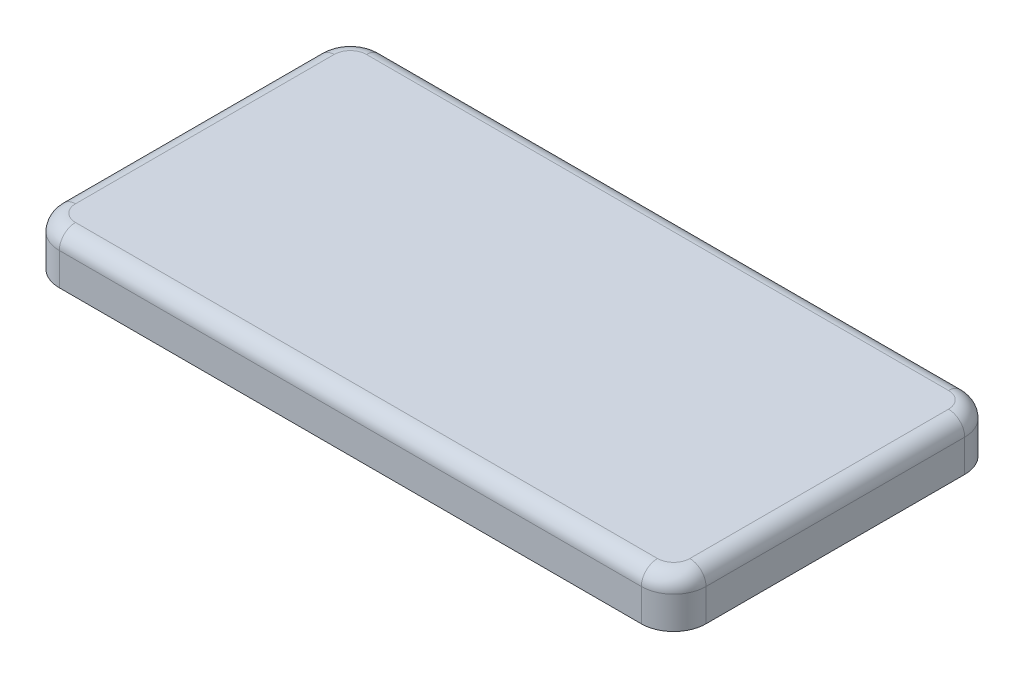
ISO-10303-21;
HEADER;
FILE_DESCRIPTION(('STEP AP214'),'2;1');
FILE_NAME('part.step','',(''),(''),'','','');
FILE_SCHEMA(('AUTOMOTIVE_DESIGN { 1 0 10303 214 1 1 1 1 }'));
ENDSEC;
DATA;
#1=APPLICATION_CONTEXT('core data for automotive mechanical design processes');
#2=APPLICATION_PROTOCOL_DEFINITION('international standard','automotive_design',2000,#1);
#3=PRODUCT_CONTEXT('',#1,'mechanical');
#4=PRODUCT('Part','Part','',(#3));
#5=PRODUCT_RELATED_PRODUCT_CATEGORY('part','',(#4));
#6=PRODUCT_DEFINITION_FORMATION('','',#4);
#7=PRODUCT_DEFINITION_CONTEXT('part definition',#1,'design');
#8=PRODUCT_DEFINITION('design','',#6,#7);
#9=PRODUCT_DEFINITION_SHAPE('','',#8);
#10=(LENGTH_UNIT() NAMED_UNIT(*) SI_UNIT(.MILLI.,.METRE.));
#11=(NAMED_UNIT(*) PLANE_ANGLE_UNIT() SI_UNIT($,.RADIAN.));
#12=(NAMED_UNIT(*) SI_UNIT($,.STERADIAN.) SOLID_ANGLE_UNIT());
#13=UNCERTAINTY_MEASURE_WITH_UNIT(LENGTH_MEASURE(1.E-05),#10,'distance_accuracy_value','');
#14=(GEOMETRIC_REPRESENTATION_CONTEXT(3) GLOBAL_UNCERTAINTY_ASSIGNED_CONTEXT((#13)) GLOBAL_UNIT_ASSIGNED_CONTEXT((#10,
#11,#12)) REPRESENTATION_CONTEXT('',''));
#15=CARTESIAN_POINT('',(0.,0.,0.));
#16=DIRECTION('',(0.,0.,1.));
#17=DIRECTION('',(1.,0.,0.));
#18=AXIS2_PLACEMENT_3D('',#15,#16,#17);
#19=CARTESIAN_POINT('',(-18.,-0.5,8.));
#20=DIRECTION('',(0.,-1.,0.));
#21=DIRECTION('',(0.,0.,-1.));
#22=AXIS2_PLACEMENT_3D('',#19,#20,#21);
#23=PLANE('',#22);
#24=DIRECTION('',(1.,0.,0.));
#25=VECTOR('',#24,1.);
#26=CARTESIAN_POINT('',(-12.15,-0.5,-1.3));
#27=LINE('',#26,#25);
#28=CARTESIAN_POINT('',(-12.15,-0.5,-1.3));
#29=VERTEX_POINT('',#28);
#30=CARTESIAN_POINT('',(-7.85,-0.5,-1.3));
#31=VERTEX_POINT('',#30);
#32=EDGE_CURVE('E284',#29,#31,#27,.T.);
#33=ORIENTED_EDGE('',*,*,#32,.F.);
#34=DIRECTION('',(0.,0.,-1.));
#35=VECTOR('',#34,1.);
#36=CARTESIAN_POINT('',(-12.15,-0.5,1.3));
#37=LINE('',#36,#35);
#38=CARTESIAN_POINT('',(-12.15,-0.5,1.3));
#39=VERTEX_POINT('',#38);
#40=EDGE_CURVE('E258',#39,#29,#37,.T.);
#41=ORIENTED_EDGE('',*,*,#40,.F.);
#42=DIRECTION('',(-1.,0.,0.));
#43=VECTOR('',#42,1.);
#44=CARTESIAN_POINT('',(-12.15,-0.5,1.3));
#45=LINE('',#44,#43);
#46=CARTESIAN_POINT('',(-7.85,-0.5,1.3));
#47=VERTEX_POINT('',#46);
#48=EDGE_CURVE('E290',#47,#39,#45,.T.);
#49=ORIENTED_EDGE('',*,*,#48,.F.);
#50=DIRECTION('',(0.,0.,1.));
#51=VECTOR('',#50,1.);
#52=CARTESIAN_POINT('',(-7.85,-0.5,1.3));
#53=LINE('',#52,#51);
#54=EDGE_CURVE('E287',#31,#47,#53,.T.);
#55=ORIENTED_EDGE('',*,*,#54,.F.);
#56=EDGE_LOOP('',(#33,#41,#49,#55));
#57=FACE_BOUND('',#56,.T.);
#58=CARTESIAN_POINT('',(-18.,-0.5,8.));
#59=DIRECTION('',(0.,-1.,0.));
#60=DIRECTION('',(0.,0.,-1.));
#61=AXIS2_PLACEMENT_3D('',#58,#59,#60);
#62=CIRCLE('',#61,0.799999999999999);
#63=CARTESIAN_POINT('',(-18.,-0.5,8.8));
#64=VERTEX_POINT('',#63);
#65=CARTESIAN_POINT('',(-18.8,-0.5,8.));
#66=VERTEX_POINT('',#65);
#67=EDGE_CURVE('E302',#64,#66,#62,.T.);
#68=ORIENTED_EDGE('',*,*,#67,.T.);
#69=DIRECTION('',(0.,0.,-1.));
#70=VECTOR('',#69,1.);
#71=CARTESIAN_POINT('',(-18.8,-0.5,8.));
#72=LINE('',#71,#70);
#73=CARTESIAN_POINT('',(-18.8,-0.5,-8.));
#74=VERTEX_POINT('',#73);
#75=EDGE_CURVE('E305',#66,#74,#72,.T.);
#76=ORIENTED_EDGE('',*,*,#75,.T.);
#77=CARTESIAN_POINT('',(-18.,-0.5,-8.));
#78=DIRECTION('',(0.,-1.,0.));
#79=DIRECTION('',(0.,0.,-1.));
#80=AXIS2_PLACEMENT_3D('',#77,#78,#79);
#81=CIRCLE('',#80,0.8);
#82=CARTESIAN_POINT('',(-18.,-0.5,-8.8));
#83=VERTEX_POINT('',#82);
#84=EDGE_CURVE('E309',#74,#83,#81,.T.);
#85=ORIENTED_EDGE('',*,*,#84,.T.);
#86=DIRECTION('',(1.,0.,0.));
#87=VECTOR('',#86,1.);
#88=CARTESIAN_POINT('',(-18.,-0.5,-8.8));
#89=LINE('',#88,#87);
#90=CARTESIAN_POINT('',(18.,-0.5,-8.8));
#91=VERTEX_POINT('',#90);
#92=EDGE_CURVE('E312',#83,#91,#89,.T.);
#93=ORIENTED_EDGE('',*,*,#92,.T.);
#94=CARTESIAN_POINT('',(18.,-0.5,-8.));
#95=DIRECTION('',(0.,-1.,0.));
#96=DIRECTION('',(0.,0.,-1.));
#97=AXIS2_PLACEMENT_3D('',#94,#95,#96);
#98=CIRCLE('',#97,0.8);
#99=CARTESIAN_POINT('',(18.8,-0.5,-8.));
#100=VERTEX_POINT('',#99);
#101=EDGE_CURVE('E315',#91,#100,#98,.T.);
#102=ORIENTED_EDGE('',*,*,#101,.T.);
#103=DIRECTION('',(0.,0.,1.));
#104=VECTOR('',#103,1.);
#105=CARTESIAN_POINT('',(18.8,-0.5,8.));
#106=LINE('',#105,#104);
#107=CARTESIAN_POINT('',(18.8,-0.5,8.));
#108=VERTEX_POINT('',#107);
#109=EDGE_CURVE('E318',#100,#108,#106,.T.);
#110=ORIENTED_EDGE('',*,*,#109,.T.);
#111=CARTESIAN_POINT('',(18.,-0.5,8.));
#112=DIRECTION('',(0.,-1.,0.));
#113=DIRECTION('',(0.,0.,-1.));
#114=AXIS2_PLACEMENT_3D('',#111,#112,#113);
#115=CIRCLE('',#114,0.799999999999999);
#116=CARTESIAN_POINT('',(18.,-0.5,8.8));
#117=VERTEX_POINT('',#116);
#118=EDGE_CURVE('E321',#108,#117,#115,.T.);
#119=ORIENTED_EDGE('',*,*,#118,.T.);
#120=DIRECTION('',(-1.,0.,0.));
#121=VECTOR('',#120,1.);
#122=CARTESIAN_POINT('',(-18.,-0.5,8.8));
#123=LINE('',#122,#121);
#124=EDGE_CURVE('E324',#117,#64,#123,.T.);
#125=ORIENTED_EDGE('',*,*,#124,.T.);
#126=EDGE_LOOP('',(#68,#76,#85,#93,#102,#110,#119,#125));
#127=FACE_BOUND('',#126,.T.);
#128=DIRECTION('',(1.,0.,0.));
#129=VECTOR('',#128,1.);
#130=CARTESIAN_POINT('',(7.85,-0.5,-1.3));
#131=LINE('',#130,#129);
#132=CARTESIAN_POINT('',(7.85,-0.5,-1.3));
#133=VERTEX_POINT('',#132);
#134=CARTESIAN_POINT('',(12.15,-0.5,-1.3));
#135=VERTEX_POINT('',#134);
#136=EDGE_CURVE('E252',#133,#135,#131,.T.);
#137=ORIENTED_EDGE('',*,*,#136,.F.);
#138=DIRECTION('',(0.,0.,-1.));
#139=VECTOR('',#138,1.);
#140=CARTESIAN_POINT('',(7.85,-0.5,1.3));
#141=LINE('',#140,#139);
#142=CARTESIAN_POINT('',(7.85,-0.5,1.3));
#143=VERTEX_POINT('',#142);
#144=EDGE_CURVE('E262',#143,#133,#141,.T.);
#145=ORIENTED_EDGE('',*,*,#144,.F.);
#146=DIRECTION('',(-1.,0.,0.));
#147=VECTOR('',#146,1.);
#148=CARTESIAN_POINT('',(7.85,-0.5,1.3));
#149=LINE('',#148,#147);
#150=CARTESIAN_POINT('',(12.15,-0.5,1.3));
#151=VERTEX_POINT('',#150);
#152=EDGE_CURVE('E274',#151,#143,#149,.T.);
#153=ORIENTED_EDGE('',*,*,#152,.F.);
#154=DIRECTION('',(0.,0.,1.));
#155=VECTOR('',#154,1.);
#156=CARTESIAN_POINT('',(12.15,-0.5,1.3));
#157=LINE('',#156,#155);
#158=EDGE_CURVE('E272',#135,#151,#157,.T.);
#159=ORIENTED_EDGE('',*,*,#158,.F.);
#160=EDGE_LOOP('',(#137,#145,#153,#159));
#161=FACE_BOUND('',#160,.T.);
#162=ADVANCED_FACE('F37',(#57,#127,#161),#23,.T.);
#163=CARTESIAN_POINT('',(-18.,1.5,-8.));
#164=DIRECTION('',(0.,-1.,0.));
#165=DIRECTION('',(0.,0.,-1.));
#166=AXIS2_PLACEMENT_3D('',#163,#164,#165);
#167=CYLINDRICAL_SURFACE('',#166,2.);
#168=DIRECTION('',(0.,-1.,0.));
#169=VECTOR('',#168,1.);
#170=CARTESIAN_POINT('',(-20.,1.5,-8.));
#171=LINE('',#170,#169);
#172=CARTESIAN_POINT('',(-20.,0.5,-8.));
#173=VERTEX_POINT('',#172);
#174=CARTESIAN_POINT('',(-20.,-1.5,-8.));
#175=VERTEX_POINT('',#174);
#176=EDGE_CURVE('E405',#173,#175,#171,.T.);
#177=ORIENTED_EDGE('',*,*,#176,.F.);
#178=CARTESIAN_POINT('',(-18.,0.5,-8.));
#179=DIRECTION('',(0.,1.,0.));
#180=DIRECTION('',(0.,0.,1.));
#181=AXIS2_PLACEMENT_3D('',#178,#179,#180);
#182=CIRCLE('',#181,2.);
#183=CARTESIAN_POINT('',(-18.,0.5,-10.));
#184=VERTEX_POINT('',#183);
#185=EDGE_CURVE('E429',#173,#184,#182,.F.);
#186=ORIENTED_EDGE('',*,*,#185,.T.);
#187=DIRECTION('',(0.,-1.,0.));
#188=VECTOR('',#187,1.);
#189=CARTESIAN_POINT('',(-18.,1.5,-10.));
#190=LINE('',#189,#188);
#191=CARTESIAN_POINT('',(-18.,-1.5,-10.));
#192=VERTEX_POINT('',#191);
#193=EDGE_CURVE('E391',#184,#192,#190,.T.);
#194=ORIENTED_EDGE('',*,*,#193,.T.);
#195=CARTESIAN_POINT('',(-18.,-1.5,-8.));
#196=DIRECTION('',(0.,1.,0.));
#197=DIRECTION('',(0.,0.,1.));
#198=AXIS2_PLACEMENT_3D('',#195,#196,#197);
#199=CIRCLE('',#198,2.);
#200=EDGE_CURVE('E366',#192,#175,#199,.T.);
#201=ORIENTED_EDGE('',*,*,#200,.T.);
#202=EDGE_LOOP('',(#177,#186,#194,#201));
#203=FACE_BOUND('',#202,.T.);
#204=ADVANCED_FACE('F545',(#203),#167,.T.);
#205=CARTESIAN_POINT('',(-20.,1.5,8.));
#206=DIRECTION('',(1.,0.,0.));
#207=DIRECTION('',(0.,0.,-1.));
#208=AXIS2_PLACEMENT_3D('',#205,#206,#207);
#209=PLANE('',#208);
#210=DIRECTION('',(0.,-1.,0.));
#211=VECTOR('',#210,1.);
#212=CARTESIAN_POINT('',(-20.,1.5,8.));
#213=LINE('',#212,#211);
#214=CARTESIAN_POINT('',(-20.,0.5,8.));
#215=VERTEX_POINT('',#214);
#216=CARTESIAN_POINT('',(-20.,-1.5,8.));
#217=VERTEX_POINT('',#216);
#218=EDGE_CURVE('E403',#215,#217,#213,.T.);
#219=ORIENTED_EDGE('',*,*,#218,.F.);
#220=DIRECTION('',(0.,0.,1.));
#221=VECTOR('',#220,1.);
#222=CARTESIAN_POINT('',(-20.,0.5,-8.));
#223=LINE('',#222,#221);
#224=EDGE_CURVE('E427',#215,#173,#223,.F.);
#225=ORIENTED_EDGE('',*,*,#224,.T.);
#226=ORIENTED_EDGE('',*,*,#176,.T.);
#227=DIRECTION('',(0.,0.,1.));
#228=VECTOR('',#227,1.);
#229=CARTESIAN_POINT('',(-20.,-1.5,8.));
#230=LINE('',#229,#228);
#231=EDGE_CURVE('E369',#175,#217,#230,.T.);
#232=ORIENTED_EDGE('',*,*,#231,.T.);
#233=EDGE_LOOP('',(#219,#225,#226,#232));
#234=FACE_BOUND('',#233,.T.);
#235=ADVANCED_FACE('F551',(#234),#209,.F.);
#236=CARTESIAN_POINT('',(-18.,1.5,8.));
#237=DIRECTION('',(0.,-1.,0.));
#238=DIRECTION('',(0.,0.,-1.));
#239=AXIS2_PLACEMENT_3D('',#236,#237,#238);
#240=CYLINDRICAL_SURFACE('',#239,2.);
#241=DIRECTION('',(0.,-1.,0.));
#242=VECTOR('',#241,1.);
#243=CARTESIAN_POINT('',(-18.,1.5,10.));
#244=LINE('',#243,#242);
#245=CARTESIAN_POINT('',(-18.,0.5,10.));
#246=VERTEX_POINT('',#245);
#247=CARTESIAN_POINT('',(-18.,-1.5,10.));
#248=VERTEX_POINT('',#247);
#249=EDGE_CURVE('E401',#246,#248,#244,.T.);
#250=ORIENTED_EDGE('',*,*,#249,.F.);
#251=CARTESIAN_POINT('',(-18.,0.5,8.));
#252=DIRECTION('',(0.,1.,0.));
#253=DIRECTION('',(0.,0.,1.));
#254=AXIS2_PLACEMENT_3D('',#251,#252,#253);
#255=CIRCLE('',#254,2.);
#256=EDGE_CURVE('E424',#246,#215,#255,.F.);
#257=ORIENTED_EDGE('',*,*,#256,.T.);
#258=ORIENTED_EDGE('',*,*,#218,.T.);
#259=CARTESIAN_POINT('',(-18.,-1.5,8.));
#260=DIRECTION('',(0.,1.,0.));
#261=DIRECTION('',(0.,0.,1.));
#262=AXIS2_PLACEMENT_3D('',#259,#260,#261);
#263=CIRCLE('',#262,2.);
#264=EDGE_CURVE('E373',#217,#248,#263,.T.);
#265=ORIENTED_EDGE('',*,*,#264,.T.);
#266=EDGE_LOOP('',(#250,#257,#258,#265));
#267=FACE_BOUND('',#266,.T.);
#268=ADVANCED_FACE('F621',(#267),#240,.T.);
#269=CARTESIAN_POINT('',(-18.,1.5,10.));
#270=DIRECTION('',(0.,0.,-1.));
#271=DIRECTION('',(-1.,0.,0.));
#272=AXIS2_PLACEMENT_3D('',#269,#270,#271);
#273=PLANE('',#272);
#274=DIRECTION('',(0.,-1.,0.));
#275=VECTOR('',#274,1.);
#276=CARTESIAN_POINT('',(18.,1.5,10.));
#277=LINE('',#276,#275);
#278=CARTESIAN_POINT('',(18.,0.5,10.));
#279=VERTEX_POINT('',#278);
#280=CARTESIAN_POINT('',(18.,-1.5,10.));
#281=VERTEX_POINT('',#280);
#282=EDGE_CURVE('E399',#279,#281,#277,.T.);
#283=ORIENTED_EDGE('',*,*,#282,.F.);
#284=DIRECTION('',(1.,0.,0.));
#285=VECTOR('',#284,1.);
#286=CARTESIAN_POINT('',(-18.,0.5,10.));
#287=LINE('',#286,#285);
#288=EDGE_CURVE('E439',#279,#246,#287,.F.);
#289=ORIENTED_EDGE('',*,*,#288,.T.);
#290=ORIENTED_EDGE('',*,*,#249,.T.);
#291=DIRECTION('',(1.,0.,0.));
#292=VECTOR('',#291,1.);
#293=CARTESIAN_POINT('',(-18.,-1.5,10.));
#294=LINE('',#293,#292);
#295=EDGE_CURVE('E376',#248,#281,#294,.T.);
#296=ORIENTED_EDGE('',*,*,#295,.T.);
#297=EDGE_LOOP('',(#283,#289,#290,#296));
#298=FACE_BOUND('',#297,.T.);
#299=ADVANCED_FACE('F617',(#298),#273,.F.);
#300=CARTESIAN_POINT('',(18.,1.5,8.));
#301=DIRECTION('',(0.,-1.,0.));
#302=DIRECTION('',(0.,0.,-1.));
#303=AXIS2_PLACEMENT_3D('',#300,#301,#302);
#304=CYLINDRICAL_SURFACE('',#303,2.);
#305=DIRECTION('',(0.,-1.,0.));
#306=VECTOR('',#305,1.);
#307=CARTESIAN_POINT('',(20.,1.5,8.));
#308=LINE('',#307,#306);
#309=CARTESIAN_POINT('',(20.,0.5,8.));
#310=VERTEX_POINT('',#309);
#311=CARTESIAN_POINT('',(20.,-1.5,8.));
#312=VERTEX_POINT('',#311);
#313=EDGE_CURVE('E397',#310,#312,#308,.T.);
#314=ORIENTED_EDGE('',*,*,#313,.F.);
#315=CARTESIAN_POINT('',(18.,0.5,8.));
#316=DIRECTION('',(0.,1.,0.));
#317=DIRECTION('',(0.,0.,1.));
#318=AXIS2_PLACEMENT_3D('',#315,#316,#317);
#319=CIRCLE('',#318,2.);
#320=EDGE_CURVE('E437',#310,#279,#319,.F.);
#321=ORIENTED_EDGE('',*,*,#320,.T.);
#322=ORIENTED_EDGE('',*,*,#282,.T.);
#323=CARTESIAN_POINT('',(18.,-1.5,8.));
#324=DIRECTION('',(0.,1.,0.));
#325=DIRECTION('',(0.,0.,1.));
#326=AXIS2_PLACEMENT_3D('',#323,#324,#325);
#327=CIRCLE('',#326,2.);
#328=EDGE_CURVE('E379',#281,#312,#327,.T.);
#329=ORIENTED_EDGE('',*,*,#328,.T.);
#330=EDGE_LOOP('',(#314,#321,#322,#329));
#331=FACE_BOUND('',#330,.T.);
#332=ADVANCED_FACE('F613',(#331),#304,.T.);
#333=CARTESIAN_POINT('',(20.,1.5,8.));
#334=DIRECTION('',(-1.,0.,0.));
#335=DIRECTION('',(0.,0.,1.));
#336=AXIS2_PLACEMENT_3D('',#333,#334,#335);
#337=PLANE('',#336);
#338=DIRECTION('',(0.,-1.,0.));
#339=VECTOR('',#338,1.);
#340=CARTESIAN_POINT('',(20.,1.5,-8.));
#341=LINE('',#340,#339);
#342=CARTESIAN_POINT('',(20.,0.5,-8.));
#343=VERTEX_POINT('',#342);
#344=CARTESIAN_POINT('',(20.,-1.5,-8.));
#345=VERTEX_POINT('',#344);
#346=EDGE_CURVE('E395',#343,#345,#341,.T.);
#347=ORIENTED_EDGE('',*,*,#346,.F.);
#348=DIRECTION('',(0.,0.,-1.));
#349=VECTOR('',#348,1.);
#350=CARTESIAN_POINT('',(20.,0.5,8.));
#351=LINE('',#350,#349);
#352=EDGE_CURVE('E435',#343,#310,#351,.F.);
#353=ORIENTED_EDGE('',*,*,#352,.T.);
#354=ORIENTED_EDGE('',*,*,#313,.T.);
#355=DIRECTION('',(0.,0.,-1.));
#356=VECTOR('',#355,1.);
#357=CARTESIAN_POINT('',(20.,-1.5,8.));
#358=LINE('',#357,#356);
#359=EDGE_CURVE('E382',#312,#345,#358,.T.);
#360=ORIENTED_EDGE('',*,*,#359,.T.);
#361=EDGE_LOOP('',(#347,#353,#354,#360));
#362=FACE_BOUND('',#361,.T.);
#363=ADVANCED_FACE('F609',(#362),#337,.F.);
#364=CARTESIAN_POINT('',(18.,1.5,-8.));
#365=DIRECTION('',(0.,-1.,0.));
#366=DIRECTION('',(0.,0.,-1.));
#367=AXIS2_PLACEMENT_3D('',#364,#365,#366);
#368=CYLINDRICAL_SURFACE('',#367,2.);
#369=DIRECTION('',(0.,-1.,0.));
#370=VECTOR('',#369,1.);
#371=CARTESIAN_POINT('',(18.,1.5,-10.));
#372=LINE('',#371,#370);
#373=CARTESIAN_POINT('',(18.,0.5,-10.));
#374=VERTEX_POINT('',#373);
#375=CARTESIAN_POINT('',(18.,-1.5,-10.));
#376=VERTEX_POINT('',#375);
#377=EDGE_CURVE('E393',#374,#376,#372,.T.);
#378=ORIENTED_EDGE('',*,*,#377,.F.);
#379=CARTESIAN_POINT('',(18.,0.5,-8.));
#380=DIRECTION('',(0.,1.,0.));
#381=DIRECTION('',(0.,0.,1.));
#382=AXIS2_PLACEMENT_3D('',#379,#380,#381);
#383=CIRCLE('',#382,2.);
#384=EDGE_CURVE('E433',#374,#343,#383,.F.);
#385=ORIENTED_EDGE('',*,*,#384,.T.);
#386=ORIENTED_EDGE('',*,*,#346,.T.);
#387=CARTESIAN_POINT('',(18.,-1.5,-8.));
#388=DIRECTION('',(0.,1.,0.));
#389=DIRECTION('',(0.,0.,1.));
#390=AXIS2_PLACEMENT_3D('',#387,#388,#389);
#391=CIRCLE('',#390,2.);
#392=EDGE_CURVE('E385',#345,#376,#391,.T.);
#393=ORIENTED_EDGE('',*,*,#392,.T.);
#394=EDGE_LOOP('',(#378,#385,#386,#393));
#395=FACE_BOUND('',#394,.T.);
#396=ADVANCED_FACE('F605',(#395),#368,.T.);
#397=CARTESIAN_POINT('',(-18.,1.5,-10.));
#398=DIRECTION('',(0.,0.,1.));
#399=DIRECTION('',(1.,0.,0.));
#400=AXIS2_PLACEMENT_3D('',#397,#398,#399);
#401=PLANE('',#400);
#402=ORIENTED_EDGE('',*,*,#193,.F.);
#403=DIRECTION('',(-1.,0.,0.));
#404=VECTOR('',#403,1.);
#405=CARTESIAN_POINT('',(18.,0.5,-10.));
#406=LINE('',#405,#404);
#407=EDGE_CURVE('E431',#184,#374,#406,.F.);
#408=ORIENTED_EDGE('',*,*,#407,.T.);
#409=ORIENTED_EDGE('',*,*,#377,.T.);
#410=DIRECTION('',(-1.,0.,0.));
#411=VECTOR('',#410,1.);
#412=CARTESIAN_POINT('',(-18.,-1.5,-10.));
#413=LINE('',#412,#411);
#414=EDGE_CURVE('E388',#376,#192,#413,.T.);
#415=ORIENTED_EDGE('',*,*,#414,.T.);
#416=EDGE_LOOP('',(#402,#408,#409,#415));
#417=FACE_BOUND('',#416,.T.);
#418=ADVANCED_FACE('F597',(#417),#401,.F.);
#419=CARTESIAN_POINT('',(-18.,1.5,-8.));
#420=DIRECTION('',(0.,1.,0.));
#421=DIRECTION('',(0.,0.,1.));
#422=AXIS2_PLACEMENT_3D('',#419,#420,#421);
#423=PLANE('',#422);
#424=DIRECTION('',(0.,0.,1.));
#425=VECTOR('',#424,1.);
#426=CARTESIAN_POINT('',(-19.,1.5,8.));
#427=LINE('',#426,#425);
#428=CARTESIAN_POINT('',(-19.,1.5,-8.));
#429=VERTEX_POINT('',#428);
#430=CARTESIAN_POINT('',(-19.,1.5,8.));
#431=VERTEX_POINT('',#430);
#432=EDGE_CURVE('E419',#429,#431,#427,.T.);
#433=ORIENTED_EDGE('',*,*,#432,.T.);
#434=CARTESIAN_POINT('',(-18.,1.5,8.));
#435=DIRECTION('',(0.,1.,0.));
#436=DIRECTION('',(0.,0.,1.));
#437=AXIS2_PLACEMENT_3D('',#434,#435,#436);
#438=CIRCLE('',#437,0.999999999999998);
#439=CARTESIAN_POINT('',(-18.,1.5,9.));
#440=VERTEX_POINT('',#439);
#441=EDGE_CURVE('E421',#431,#440,#438,.T.);
#442=ORIENTED_EDGE('',*,*,#441,.T.);
#443=DIRECTION('',(1.,0.,0.));
#444=VECTOR('',#443,1.);
#445=CARTESIAN_POINT('',(18.,1.5,9.));
#446=LINE('',#445,#444);
#447=CARTESIAN_POINT('',(18.,1.5,9.));
#448=VERTEX_POINT('',#447);
#449=EDGE_CURVE('E407',#440,#448,#446,.T.);
#450=ORIENTED_EDGE('',*,*,#449,.T.);
#451=CARTESIAN_POINT('',(18.,1.5,8.));
#452=DIRECTION('',(0.,1.,0.));
#453=DIRECTION('',(0.,0.,1.));
#454=AXIS2_PLACEMENT_3D('',#451,#452,#453);
#455=CIRCLE('',#454,1.);
#456=CARTESIAN_POINT('',(19.,1.5,8.));
#457=VERTEX_POINT('',#456);
#458=EDGE_CURVE('E409',#448,#457,#455,.T.);
#459=ORIENTED_EDGE('',*,*,#458,.T.);
#460=DIRECTION('',(0.,0.,-1.));
#461=VECTOR('',#460,1.);
#462=CARTESIAN_POINT('',(19.,1.5,-8.));
#463=LINE('',#462,#461);
#464=CARTESIAN_POINT('',(19.,1.5,-8.));
#465=VERTEX_POINT('',#464);
#466=EDGE_CURVE('E411',#457,#465,#463,.T.);
#467=ORIENTED_EDGE('',*,*,#466,.T.);
#468=CARTESIAN_POINT('',(18.,1.5,-8.));
#469=DIRECTION('',(0.,1.,0.));
#470=DIRECTION('',(0.,0.,1.));
#471=AXIS2_PLACEMENT_3D('',#468,#469,#470);
#472=CIRCLE('',#471,1.);
#473=CARTESIAN_POINT('',(18.,1.5,-9.));
#474=VERTEX_POINT('',#473);
#475=EDGE_CURVE('E413',#465,#474,#472,.T.);
#476=ORIENTED_EDGE('',*,*,#475,.T.);
#477=DIRECTION('',(-1.,0.,0.));
#478=VECTOR('',#477,1.);
#479=CARTESIAN_POINT('',(-18.,1.5,-9.));
#480=LINE('',#479,#478);
#481=CARTESIAN_POINT('',(-18.,1.5,-9.));
#482=VERTEX_POINT('',#481);
#483=EDGE_CURVE('E415',#474,#482,#480,.T.);
#484=ORIENTED_EDGE('',*,*,#483,.T.);
#485=CARTESIAN_POINT('',(-18.,1.5,-8.));
#486=DIRECTION('',(0.,1.,0.));
#487=DIRECTION('',(0.,0.,1.));
#488=AXIS2_PLACEMENT_3D('',#485,#486,#487);
#489=CIRCLE('',#488,0.999999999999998);
#490=EDGE_CURVE('E417',#482,#429,#489,.T.);
#491=ORIENTED_EDGE('',*,*,#490,.T.);
#492=EDGE_LOOP('',(#433,#442,#450,#459,#467,#476,#484,#491));
#493=FACE_BOUND('',#492,.T.);
#494=ADVANCED_FACE('F593',(#493),#423,.T.);
#495=CARTESIAN_POINT('',(-18.,-1.5,-8.));
#496=DIRECTION('',(0.,1.,0.));
#497=DIRECTION('',(0.,0.,1.));
#498=AXIS2_PLACEMENT_3D('',#495,#496,#497);
#499=PLANE('',#498);
#500=DIRECTION('',(0.,0.,-1.));
#501=VECTOR('',#500,1.);
#502=CARTESIAN_POINT('',(-18.8,-1.5,8.));
#503=LINE('',#502,#501);
#504=CARTESIAN_POINT('',(-18.8,-1.5,8.));
#505=VERTEX_POINT('',#504);
#506=CARTESIAN_POINT('',(-18.8,-1.5,-8.));
#507=VERTEX_POINT('',#506);
#508=EDGE_CURVE('E329',#505,#507,#503,.T.);
#509=ORIENTED_EDGE('',*,*,#508,.F.);
#510=CARTESIAN_POINT('',(-18.,-1.5,8.));
#511=DIRECTION('',(0.,-1.,0.));
#512=DIRECTION('',(0.,0.,-1.));
#513=AXIS2_PLACEMENT_3D('',#510,#511,#512);
#514=CIRCLE('',#513,0.799999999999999);
#515=CARTESIAN_POINT('',(-18.,-1.5,8.8));
#516=VERTEX_POINT('',#515);
#517=EDGE_CURVE('E296',#516,#505,#514,.T.);
#518=ORIENTED_EDGE('',*,*,#517,.F.);
#519=DIRECTION('',(-1.,0.,0.));
#520=VECTOR('',#519,1.);
#521=CARTESIAN_POINT('',(-18.,-1.5,8.8));
#522=LINE('',#521,#520);
#523=CARTESIAN_POINT('',(18.,-1.5,8.8));
#524=VERTEX_POINT('',#523);
#525=EDGE_CURVE('E306',#524,#516,#522,.T.);
#526=ORIENTED_EDGE('',*,*,#525,.F.);
#527=CARTESIAN_POINT('',(18.,-1.5,8.));
#528=DIRECTION('',(0.,-1.,0.));
#529=DIRECTION('',(0.,0.,-1.));
#530=AXIS2_PLACEMENT_3D('',#527,#528,#529);
#531=CIRCLE('',#530,0.799999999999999);
#532=CARTESIAN_POINT('',(18.8,-1.5,8.));
#533=VERTEX_POINT('',#532);
#534=EDGE_CURVE('E344',#533,#524,#531,.T.);
#535=ORIENTED_EDGE('',*,*,#534,.F.);
#536=DIRECTION('',(0.,0.,1.));
#537=VECTOR('',#536,1.);
#538=CARTESIAN_POINT('',(18.8,-1.5,8.));
#539=LINE('',#538,#537);
#540=CARTESIAN_POINT('',(18.8,-1.5,-8.));
#541=VERTEX_POINT('',#540);
#542=EDGE_CURVE('E341',#541,#533,#539,.T.);
#543=ORIENTED_EDGE('',*,*,#542,.F.);
#544=CARTESIAN_POINT('',(18.,-1.5,-8.));
#545=DIRECTION('',(0.,-1.,0.));
#546=DIRECTION('',(0.,0.,-1.));
#547=AXIS2_PLACEMENT_3D('',#544,#545,#546);
#548=CIRCLE('',#547,0.8);
#549=CARTESIAN_POINT('',(18.,-1.5,-8.8));
#550=VERTEX_POINT('',#549);
#551=EDGE_CURVE('E338',#550,#541,#548,.T.);
#552=ORIENTED_EDGE('',*,*,#551,.F.);
#553=DIRECTION('',(1.,0.,0.));
#554=VECTOR('',#553,1.);
#555=CARTESIAN_POINT('',(-18.,-1.5,-8.8));
#556=LINE('',#555,#554);
#557=CARTESIAN_POINT('',(-18.,-1.5,-8.8));
#558=VERTEX_POINT('',#557);
#559=EDGE_CURVE('E335',#558,#550,#556,.T.);
#560=ORIENTED_EDGE('',*,*,#559,.F.);
#561=CARTESIAN_POINT('',(-18.,-1.5,-8.));
#562=DIRECTION('',(0.,-1.,0.));
#563=DIRECTION('',(0.,0.,-1.));
#564=AXIS2_PLACEMENT_3D('',#561,#562,#563);
#565=CIRCLE('',#564,0.8);
#566=EDGE_CURVE('E332',#507,#558,#565,.T.);
#567=ORIENTED_EDGE('',*,*,#566,.F.);
#568=EDGE_LOOP('',(#509,#518,#526,#535,#543,#552,#560,#567));
#569=FACE_BOUND('',#568,.T.);
#570=ORIENTED_EDGE('',*,*,#200,.F.);
#571=ORIENTED_EDGE('',*,*,#414,.F.);
#572=ORIENTED_EDGE('',*,*,#392,.F.);
#573=ORIENTED_EDGE('',*,*,#359,.F.);
#574=ORIENTED_EDGE('',*,*,#328,.F.);
#575=ORIENTED_EDGE('',*,*,#295,.F.);
#576=ORIENTED_EDGE('',*,*,#264,.F.);
#577=ORIENTED_EDGE('',*,*,#231,.F.);
#578=EDGE_LOOP('',(#570,#571,#572,#573,#574,#575,#576,#577));
#579=FACE_BOUND('',#578,.T.);
#580=ADVANCED_FACE('F596',(#569,#579),#499,.F.);
#581=CARTESIAN_POINT('',(18.,0.5,-8.));
#582=DIRECTION('',(0.,1.,0.));
#583=DIRECTION('',(0.,0.,1.));
#584=AXIS2_PLACEMENT_3D('',#581,#582,#583);
#585=TOROIDAL_SURFACE('',#584,1.,1.);
#586=CARTESIAN_POINT('',(19.,0.5,-8.));
#587=DIRECTION('',(0.,0.,1.));
#588=DIRECTION('',(1.,0.,0.));
#589=AXIS2_PLACEMENT_3D('',#586,#587,#588);
#590=CIRCLE('',#589,1.);
#591=EDGE_CURVE('E457',#343,#465,#590,.T.);
#592=ORIENTED_EDGE('',*,*,#591,.F.);
#593=ORIENTED_EDGE('',*,*,#384,.F.);
#594=CARTESIAN_POINT('',(18.,0.5,-9.));
#595=DIRECTION('',(-1.,0.,0.));
#596=DIRECTION('',(0.,0.,1.));
#597=AXIS2_PLACEMENT_3D('',#594,#595,#596);
#598=CIRCLE('',#597,1.);
#599=EDGE_CURVE('E370',#474,#374,#598,.T.);
#600=ORIENTED_EDGE('',*,*,#599,.F.);
#601=ORIENTED_EDGE('',*,*,#475,.F.);
#602=EDGE_LOOP('',(#592,#593,#600,#601));
#603=FACE_BOUND('',#602,.T.);
#604=ADVANCED_FACE('F601',(#603),#585,.T.);
#605=CARTESIAN_POINT('',(-18.,0.5,-9.));
#606=DIRECTION('',(1.,0.,0.));
#607=DIRECTION('',(0.,0.,-1.));
#608=AXIS2_PLACEMENT_3D('',#605,#606,#607);
#609=CYLINDRICAL_SURFACE('',#608,1.);
#610=ORIENTED_EDGE('',*,*,#599,.T.);
#611=ORIENTED_EDGE('',*,*,#407,.F.);
#612=CARTESIAN_POINT('',(-18.,0.5,-9.));
#613=DIRECTION('',(-1.,0.,0.));
#614=DIRECTION('',(0.,0.,1.));
#615=AXIS2_PLACEMENT_3D('',#612,#613,#614);
#616=CIRCLE('',#615,1.);
#617=EDGE_CURVE('E454',#482,#184,#616,.T.);
#618=ORIENTED_EDGE('',*,*,#617,.F.);
#619=ORIENTED_EDGE('',*,*,#483,.F.);
#620=EDGE_LOOP('',(#610,#611,#618,#619));
#621=FACE_BOUND('',#620,.T.);
#622=ADVANCED_FACE('F651',(#621),#609,.T.);
#623=CARTESIAN_POINT('',(19.,0.5,-8.));
#624=DIRECTION('',(0.,0.,1.));
#625=DIRECTION('',(1.,0.,0.));
#626=AXIS2_PLACEMENT_3D('',#623,#624,#625);
#627=CYLINDRICAL_SURFACE('',#626,1.);
#628=ORIENTED_EDGE('',*,*,#591,.T.);
#629=ORIENTED_EDGE('',*,*,#466,.F.);
#630=CARTESIAN_POINT('',(19.,0.5,8.));
#631=DIRECTION('',(0.,0.,1.));
#632=DIRECTION('',(1.,0.,0.));
#633=AXIS2_PLACEMENT_3D('',#630,#631,#632);
#634=CIRCLE('',#633,1.);
#635=EDGE_CURVE('E451',#310,#457,#634,.T.);
#636=ORIENTED_EDGE('',*,*,#635,.F.);
#637=ORIENTED_EDGE('',*,*,#352,.F.);
#638=EDGE_LOOP('',(#628,#629,#636,#637));
#639=FACE_BOUND('',#638,.T.);
#640=ADVANCED_FACE('F647',(#639),#627,.T.);
#641=CARTESIAN_POINT('',(-18.,0.5,-8.));
#642=DIRECTION('',(0.,1.,0.));
#643=DIRECTION('',(0.,0.,1.));
#644=AXIS2_PLACEMENT_3D('',#641,#642,#643);
#645=DEGENERATE_TOROIDAL_SURFACE('',#644,0.999999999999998,1.,.T.);
#646=ORIENTED_EDGE('',*,*,#617,.T.);
#647=ORIENTED_EDGE('',*,*,#185,.F.);
#648=CARTESIAN_POINT('',(-19.,0.5,-8.));
#649=DIRECTION('',(0.,0.,1.));
#650=DIRECTION('',(1.,0.,0.));
#651=AXIS2_PLACEMENT_3D('',#648,#649,#650);
#652=CIRCLE('',#651,1.);
#653=EDGE_CURVE('E448',#429,#173,#652,.T.);
#654=ORIENTED_EDGE('',*,*,#653,.F.);
#655=ORIENTED_EDGE('',*,*,#490,.F.);
#656=EDGE_LOOP('',(#646,#647,#654,#655));
#657=FACE_BOUND('',#656,.T.);
#658=ADVANCED_FACE('F643',(#657),#645,.T.);
#659=CARTESIAN_POINT('',(18.,0.5,8.));
#660=DIRECTION('',(0.,1.,0.));
#661=DIRECTION('',(0.,0.,1.));
#662=AXIS2_PLACEMENT_3D('',#659,#660,#661);
#663=TOROIDAL_SURFACE('',#662,1.,1.);
#664=ORIENTED_EDGE('',*,*,#635,.T.);
#665=ORIENTED_EDGE('',*,*,#458,.F.);
#666=CARTESIAN_POINT('',(18.,0.5,9.));
#667=DIRECTION('',(-1.,0.,0.));
#668=DIRECTION('',(0.,0.,1.));
#669=AXIS2_PLACEMENT_3D('',#666,#667,#668);
#670=CIRCLE('',#669,1.);
#671=EDGE_CURVE('E445',#279,#448,#670,.T.);
#672=ORIENTED_EDGE('',*,*,#671,.F.);
#673=ORIENTED_EDGE('',*,*,#320,.F.);
#674=EDGE_LOOP('',(#664,#665,#672,#673));
#675=FACE_BOUND('',#674,.T.);
#676=ADVANCED_FACE('F639',(#675),#663,.T.);
#677=CARTESIAN_POINT('',(-19.,0.5,-8.));
#678=DIRECTION('',(0.,0.,-1.));
#679=DIRECTION('',(-1.,0.,0.));
#680=AXIS2_PLACEMENT_3D('',#677,#678,#679);
#681=CYLINDRICAL_SURFACE('',#680,1.);
#682=ORIENTED_EDGE('',*,*,#653,.T.);
#683=ORIENTED_EDGE('',*,*,#224,.F.);
#684=CARTESIAN_POINT('',(-19.,0.5,8.));
#685=DIRECTION('',(0.,0.,1.));
#686=DIRECTION('',(1.,0.,0.));
#687=AXIS2_PLACEMENT_3D('',#684,#685,#686);
#688=CIRCLE('',#687,1.);
#689=EDGE_CURVE('E443',#431,#215,#688,.T.);
#690=ORIENTED_EDGE('',*,*,#689,.F.);
#691=ORIENTED_EDGE('',*,*,#432,.F.);
#692=EDGE_LOOP('',(#682,#683,#690,#691));
#693=FACE_BOUND('',#692,.T.);
#694=ADVANCED_FACE('F635',(#693),#681,.T.);
#695=CARTESIAN_POINT('',(-18.,0.5,9.));
#696=DIRECTION('',(-1.,0.,0.));
#697=DIRECTION('',(0.,0.,1.));
#698=AXIS2_PLACEMENT_3D('',#695,#696,#697);
#699=CYLINDRICAL_SURFACE('',#698,1.);
#700=ORIENTED_EDGE('',*,*,#671,.T.);
#701=ORIENTED_EDGE('',*,*,#449,.F.);
#702=CARTESIAN_POINT('',(-18.,0.5,9.));
#703=DIRECTION('',(-1.,0.,0.));
#704=DIRECTION('',(0.,0.,1.));
#705=AXIS2_PLACEMENT_3D('',#702,#703,#704);
#706=CIRCLE('',#705,1.);
#707=EDGE_CURVE('E351',#246,#440,#706,.T.);
#708=ORIENTED_EDGE('',*,*,#707,.F.);
#709=ORIENTED_EDGE('',*,*,#288,.F.);
#710=EDGE_LOOP('',(#700,#701,#708,#709));
#711=FACE_BOUND('',#710,.T.);
#712=ADVANCED_FACE('F631',(#711),#699,.T.);
#713=CARTESIAN_POINT('',(-18.,0.5,8.));
#714=DIRECTION('',(0.,1.,0.));
#715=DIRECTION('',(0.,0.,1.));
#716=AXIS2_PLACEMENT_3D('',#713,#714,#715);
#717=DEGENERATE_TOROIDAL_SURFACE('',#716,0.999999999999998,1.,.T.);
#718=ORIENTED_EDGE('',*,*,#689,.T.);
#719=ORIENTED_EDGE('',*,*,#256,.F.);
#720=ORIENTED_EDGE('',*,*,#707,.T.);
#721=ORIENTED_EDGE('',*,*,#441,.F.);
#722=EDGE_LOOP('',(#718,#719,#720,#721));
#723=FACE_BOUND('',#722,.T.);
#724=ADVANCED_FACE('F591',(#723),#717,.T.);
#725=CARTESIAN_POINT('',(-18.,-0.5,8.));
#726=DIRECTION('',(0.,-1.,0.));
#727=DIRECTION('',(0.,0.,-1.));
#728=AXIS2_PLACEMENT_3D('',#725,#726,#727);
#729=CYLINDRICAL_SURFACE('',#728,0.799999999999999);
#730=ORIENTED_EDGE('',*,*,#517,.T.);
#731=DIRECTION('',(0.,-1.,0.));
#732=VECTOR('',#731,1.);
#733=CARTESIAN_POINT('',(-18.8,-0.5,8.));
#734=LINE('',#733,#732);
#735=EDGE_CURVE('E327',#66,#505,#734,.T.);
#736=ORIENTED_EDGE('',*,*,#735,.F.);
#737=ORIENTED_EDGE('',*,*,#67,.F.);
#738=DIRECTION('',(0.,-1.,0.));
#739=VECTOR('',#738,1.);
#740=CARTESIAN_POINT('',(-18.,-0.5,8.8));
#741=LINE('',#740,#739);
#742=EDGE_CURVE('E349',#64,#516,#741,.T.);
#743=ORIENTED_EDGE('',*,*,#742,.T.);
#744=EDGE_LOOP('',(#730,#736,#737,#743));
#745=FACE_BOUND('',#744,.T.);
#746=ADVANCED_FACE('F564',(#745),#729,.F.);
#747=CARTESIAN_POINT('',(-18.,-0.5,8.8));
#748=DIRECTION('',(0.,0.,1.));
#749=DIRECTION('',(1.,0.,0.));
#750=AXIS2_PLACEMENT_3D('',#747,#748,#749);
#751=PLANE('',#750);
#752=ORIENTED_EDGE('',*,*,#525,.T.);
#753=ORIENTED_EDGE('',*,*,#742,.F.);
#754=ORIENTED_EDGE('',*,*,#124,.F.);
#755=DIRECTION('',(0.,-1.,0.));
#756=VECTOR('',#755,1.);
#757=CARTESIAN_POINT('',(18.,-0.5,8.8));
#758=LINE('',#757,#756);
#759=EDGE_CURVE('E352',#117,#524,#758,.T.);
#760=ORIENTED_EDGE('',*,*,#759,.T.);
#761=EDGE_LOOP('',(#752,#753,#754,#760));
#762=FACE_BOUND('',#761,.T.);
#763=ADVANCED_FACE('F560',(#762),#751,.F.);
#764=CARTESIAN_POINT('',(18.,-0.5,8.));
#765=DIRECTION('',(0.,-1.,0.));
#766=DIRECTION('',(0.,0.,-1.));
#767=AXIS2_PLACEMENT_3D('',#764,#765,#766);
#768=CYLINDRICAL_SURFACE('',#767,0.799999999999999);
#769=ORIENTED_EDGE('',*,*,#534,.T.);
#770=ORIENTED_EDGE('',*,*,#759,.F.);
#771=ORIENTED_EDGE('',*,*,#118,.F.);
#772=DIRECTION('',(0.,-1.,0.));
#773=VECTOR('',#772,1.);
#774=CARTESIAN_POINT('',(18.8,-0.5,8.));
#775=LINE('',#774,#773);
#776=EDGE_CURVE('E354',#108,#533,#775,.T.);
#777=ORIENTED_EDGE('',*,*,#776,.T.);
#778=EDGE_LOOP('',(#769,#770,#771,#777));
#779=FACE_BOUND('',#778,.T.);
#780=ADVANCED_FACE('F563',(#779),#768,.F.);
#781=CARTESIAN_POINT('',(18.8,-0.5,8.));
#782=DIRECTION('',(1.,0.,0.));
#783=DIRECTION('',(0.,0.,-1.));
#784=AXIS2_PLACEMENT_3D('',#781,#782,#783);
#785=PLANE('',#784);
#786=ORIENTED_EDGE('',*,*,#542,.T.);
#787=ORIENTED_EDGE('',*,*,#776,.F.);
#788=ORIENTED_EDGE('',*,*,#109,.F.);
#789=DIRECTION('',(0.,-1.,0.));
#790=VECTOR('',#789,1.);
#791=CARTESIAN_POINT('',(18.8,-0.5,-8.));
#792=LINE('',#791,#790);
#793=EDGE_CURVE('E356',#100,#541,#792,.T.);
#794=ORIENTED_EDGE('',*,*,#793,.T.);
#795=EDGE_LOOP('',(#786,#787,#788,#794));
#796=FACE_BOUND('',#795,.T.);
#797=ADVANCED_FACE('F568',(#796),#785,.F.);
#798=CARTESIAN_POINT('',(18.,-0.5,-8.));
#799=DIRECTION('',(0.,-1.,0.));
#800=DIRECTION('',(0.,0.,-1.));
#801=AXIS2_PLACEMENT_3D('',#798,#799,#800);
#802=CYLINDRICAL_SURFACE('',#801,0.8);
#803=ORIENTED_EDGE('',*,*,#551,.T.);
#804=ORIENTED_EDGE('',*,*,#793,.F.);
#805=ORIENTED_EDGE('',*,*,#101,.F.);
#806=DIRECTION('',(0.,-1.,0.));
#807=VECTOR('',#806,1.);
#808=CARTESIAN_POINT('',(18.,-0.5,-8.8));
#809=LINE('',#808,#807);
#810=EDGE_CURVE('E358',#91,#550,#809,.T.);
#811=ORIENTED_EDGE('',*,*,#810,.T.);
#812=EDGE_LOOP('',(#803,#804,#805,#811));
#813=FACE_BOUND('',#812,.T.);
#814=ADVANCED_FACE('F572',(#813),#802,.F.);
#815=CARTESIAN_POINT('',(-18.,-0.5,-8.8));
#816=DIRECTION('',(0.,0.,-1.));
#817=DIRECTION('',(-1.,0.,0.));
#818=AXIS2_PLACEMENT_3D('',#815,#816,#817);
#819=PLANE('',#818);
#820=ORIENTED_EDGE('',*,*,#559,.T.);
#821=ORIENTED_EDGE('',*,*,#810,.F.);
#822=ORIENTED_EDGE('',*,*,#92,.F.);
#823=DIRECTION('',(0.,-1.,0.));
#824=VECTOR('',#823,1.);
#825=CARTESIAN_POINT('',(-18.,-0.5,-8.8));
#826=LINE('',#825,#824);
#827=EDGE_CURVE('E360',#83,#558,#826,.T.);
#828=ORIENTED_EDGE('',*,*,#827,.T.);
#829=EDGE_LOOP('',(#820,#821,#822,#828));
#830=FACE_BOUND('',#829,.T.);
#831=ADVANCED_FACE('F576',(#830),#819,.F.);
#832=CARTESIAN_POINT('',(-18.,-0.5,-8.));
#833=DIRECTION('',(0.,-1.,0.));
#834=DIRECTION('',(0.,0.,-1.));
#835=AXIS2_PLACEMENT_3D('',#832,#833,#834);
#836=CYLINDRICAL_SURFACE('',#835,0.8);
#837=ORIENTED_EDGE('',*,*,#566,.T.);
#838=ORIENTED_EDGE('',*,*,#827,.F.);
#839=ORIENTED_EDGE('',*,*,#84,.F.);
#840=DIRECTION('',(0.,-1.,0.));
#841=VECTOR('',#840,1.);
#842=CARTESIAN_POINT('',(-18.8,-0.5,-8.));
#843=LINE('',#842,#841);
#844=EDGE_CURVE('E362',#74,#507,#843,.T.);
#845=ORIENTED_EDGE('',*,*,#844,.T.);
#846=EDGE_LOOP('',(#837,#838,#839,#845));
#847=FACE_BOUND('',#846,.T.);
#848=ADVANCED_FACE('F580',(#847),#836,.F.);
#849=CARTESIAN_POINT('',(-18.8,-0.5,8.));
#850=DIRECTION('',(-1.,0.,0.));
#851=DIRECTION('',(0.,0.,1.));
#852=AXIS2_PLACEMENT_3D('',#849,#850,#851);
#853=PLANE('',#852);
#854=ORIENTED_EDGE('',*,*,#508,.T.);
#855=ORIENTED_EDGE('',*,*,#844,.F.);
#856=ORIENTED_EDGE('',*,*,#75,.F.);
#857=ORIENTED_EDGE('',*,*,#735,.T.);
#858=EDGE_LOOP('',(#854,#855,#856,#857));
#859=FACE_BOUND('',#858,.T.);
#860=ADVANCED_FACE('F584',(#859),#853,.F.);
#861=CARTESIAN_POINT('',(-12.15,-0.5,1.3));
#862=DIRECTION('',(-0.999961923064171,-0.00872653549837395,0.));
#863=DIRECTION('',(0.00872653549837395,-0.999961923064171,0.));
#864=AXIS2_PLACEMENT_3D('',#861,#862,#863);
#865=PLANE('',#864);
#866=DIRECTION('',(-0.00872620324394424,0.999923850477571,-0.00872620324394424));
#867=VECTOR('',#866,1.);
#868=CARTESIAN_POINT('',(-12.15,-0.5,-1.3));
#869=LINE('',#868,#867);
#870=CARTESIAN_POINT('',(-12.0975626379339,-6.50872653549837,-1.24756263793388));
#871=VERTEX_POINT('',#870);
#872=EDGE_CURVE('E294',#871,#29,#869,.T.);
#873=ORIENTED_EDGE('',*,*,#872,.F.);
#874=DIRECTION('',(0.,0.,-1.));
#875=VECTOR('',#874,1.);
#876=CARTESIAN_POINT('',(-12.0975626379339,-6.50872653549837,1.23891192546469));
#877=LINE('',#876,#875);
#878=CARTESIAN_POINT('',(-12.0975626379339,-6.50872653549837,1.24756263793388));
#879=VERTEX_POINT('',#878);
#880=EDGE_CURVE('E11',#871,#879,#877,.F.);
#881=ORIENTED_EDGE('',*,*,#880,.T.);
#882=DIRECTION('',(-0.00872620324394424,0.999923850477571,0.00872620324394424));
#883=VECTOR('',#882,1.);
#884=CARTESIAN_POINT('',(-12.15,-0.5,1.3));
#885=LINE('',#884,#883);
#886=EDGE_CURVE('E293',#879,#39,#885,.T.);
#887=ORIENTED_EDGE('',*,*,#886,.T.);
#888=ORIENTED_EDGE('',*,*,#40,.T.);
#889=EDGE_LOOP('',(#873,#881,#887,#888));
#890=FACE_BOUND('',#889,.T.);
#891=ADVANCED_FACE('F522',(#890),#865,.T.);
#892=CARTESIAN_POINT('',(-12.15,-0.5,-1.3));
#893=DIRECTION('',(0.,-0.00872653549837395,-0.999961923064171));
#894=DIRECTION('',(0.,0.999961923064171,-0.00872653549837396));
#895=AXIS2_PLACEMENT_3D('',#892,#893,#894);
#896=PLANE('',#895);
#897=DIRECTION('',(0.00872620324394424,0.999923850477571,-0.00872620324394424));
#898=VECTOR('',#897,1.);
#899=CARTESIAN_POINT('',(-7.85019798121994,-0.52268640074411,-1.29980201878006));
#900=LINE('',#899,#898);
#901=CARTESIAN_POINT('',(-7.90243736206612,-6.50872653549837,-1.24756263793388));
#902=VERTEX_POINT('',#901);
#903=EDGE_CURVE('E297',#902,#31,#900,.T.);
#904=ORIENTED_EDGE('',*,*,#903,.F.);
#905=DIRECTION('',(1.,0.,0.));
#906=VECTOR('',#905,1.);
#907=CARTESIAN_POINT('',(-12.0889119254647,-6.50872653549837,-1.24756263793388));
#908=LINE('',#907,#906);
#909=EDGE_CURVE('E46',#902,#871,#908,.F.);
#910=ORIENTED_EDGE('',*,*,#909,.T.);
#911=ORIENTED_EDGE('',*,*,#872,.T.);
#912=ORIENTED_EDGE('',*,*,#32,.T.);
#913=EDGE_LOOP('',(#904,#910,#911,#912));
#914=FACE_BOUND('',#913,.T.);
#915=ADVANCED_FACE('F558',(#914),#896,.T.);
#916=CARTESIAN_POINT('',(-7.85,-0.5,1.3));
#917=DIRECTION('',(0.999961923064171,-0.00872653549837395,0.));
#918=DIRECTION('',(0.00872653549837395,0.999961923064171,0.));
#919=AXIS2_PLACEMENT_3D('',#916,#917,#918);
#920=PLANE('',#919);
#921=DIRECTION('',(0.00872620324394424,0.999923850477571,0.00872620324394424));
#922=VECTOR('',#921,1.);
#923=CARTESIAN_POINT('',(-7.85032743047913,-0.537519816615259,1.29967256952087));
#924=LINE('',#923,#922);
#925=CARTESIAN_POINT('',(-7.90243736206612,-6.50872653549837,1.24756263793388));
#926=VERTEX_POINT('',#925);
#927=EDGE_CURVE('E299',#926,#47,#924,.T.);
#928=ORIENTED_EDGE('',*,*,#927,.F.);
#929=DIRECTION('',(0.,0.,1.));
#930=VECTOR('',#929,1.);
#931=CARTESIAN_POINT('',(-7.90243736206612,-6.50872653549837,-1.23891192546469));
#932=LINE('',#931,#930);
#933=EDGE_CURVE('E61',#926,#902,#932,.F.);
#934=ORIENTED_EDGE('',*,*,#933,.T.);
#935=ORIENTED_EDGE('',*,*,#903,.T.);
#936=ORIENTED_EDGE('',*,*,#54,.T.);
#937=EDGE_LOOP('',(#928,#934,#935,#936));
#938=FACE_BOUND('',#937,.T.);
#939=ADVANCED_FACE('F540',(#938),#920,.T.);
#940=CARTESIAN_POINT('',(-12.15,-0.5,1.3));
#941=DIRECTION('',(0.,-0.00872653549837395,0.999961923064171));
#942=DIRECTION('',(0.,-0.999961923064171,-0.00872653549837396));
#943=AXIS2_PLACEMENT_3D('',#940,#941,#942);
#944=PLANE('',#943);
#945=ORIENTED_EDGE('',*,*,#886,.F.);
#946=DIRECTION('',(-1.,0.,0.));
#947=VECTOR('',#946,1.);
#948=CARTESIAN_POINT('',(-7.91108807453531,-6.50872653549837,1.24756263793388));
#949=LINE('',#948,#947);
#950=EDGE_CURVE('E487',#879,#926,#949,.F.);
#951=ORIENTED_EDGE('',*,*,#950,.T.);
#952=ORIENTED_EDGE('',*,*,#927,.T.);
#953=ORIENTED_EDGE('',*,*,#48,.T.);
#954=EDGE_LOOP('',(#945,#951,#952,#953));
#955=FACE_BOUND('',#954,.T.);
#956=ADVANCED_FACE('F525',(#955),#944,.T.);
#957=CARTESIAN_POINT('',(-12.15,-7.5,-1.3));
#958=DIRECTION('',(0.,-1.,0.));
#959=DIRECTION('',(0.,0.,-1.));
#960=AXIS2_PLACEMENT_3D('',#957,#958,#959);
#961=PLANE('',#960);
#962=DIRECTION('',(0.,0.,-1.));
#963=VECTOR('',#962,1.);
#964=CARTESIAN_POINT('',(-8.90239928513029,-7.5,1.23891192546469));
#965=LINE('',#964,#963);
#966=CARTESIAN_POINT('',(-8.90239928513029,-7.5,-0.24760071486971));
#967=VERTEX_POINT('',#966);
#968=CARTESIAN_POINT('',(-8.90239928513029,-7.5,0.24760071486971));
#969=VERTEX_POINT('',#968);
#970=EDGE_CURVE('E482',#967,#969,#965,.F.);
#971=ORIENTED_EDGE('',*,*,#970,.T.);
#972=DIRECTION('',(1.,0.,0.));
#973=VECTOR('',#972,1.);
#974=CARTESIAN_POINT('',(-12.0889119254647,-7.5,0.24760071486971));
#975=LINE('',#974,#973);
#976=CARTESIAN_POINT('',(-11.0976007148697,-7.5,0.24760071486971));
#977=VERTEX_POINT('',#976);
#978=EDGE_CURVE('E484',#969,#977,#975,.F.);
#979=ORIENTED_EDGE('',*,*,#978,.T.);
#980=DIRECTION('',(0.,0.,1.));
#981=VECTOR('',#980,1.);
#982=CARTESIAN_POINT('',(-11.0976007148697,-7.5,-1.23891192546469));
#983=LINE('',#982,#981);
#984=CARTESIAN_POINT('',(-11.0976007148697,-7.5,-0.24760071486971));
#985=VERTEX_POINT('',#984);
#986=EDGE_CURVE('E478',#977,#985,#983,.F.);
#987=ORIENTED_EDGE('',*,*,#986,.T.);
#988=DIRECTION('',(-1.,0.,0.));
#989=VECTOR('',#988,1.);
#990=CARTESIAN_POINT('',(-7.91108807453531,-7.5,-0.24760071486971));
#991=LINE('',#990,#989);
#992=EDGE_CURVE('E480',#985,#967,#991,.F.);
#993=ORIENTED_EDGE('',*,*,#992,.T.);
#994=EDGE_LOOP('',(#971,#979,#987,#993));
#995=FACE_BOUND('',#994,.T.);
#996=ADVANCED_FACE('F532',(#995),#961,.T.);
#997=CARTESIAN_POINT('',(7.85,-0.5,1.3));
#998=DIRECTION('',(-0.999961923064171,-0.00872653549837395,0.));
#999=DIRECTION('',(0.00872653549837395,-0.999961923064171,0.));
#1000=AXIS2_PLACEMENT_3D('',#997,#998,#999);
#1001=PLANE('',#1000);
#1002=DIRECTION('',(-0.00872620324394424,0.999923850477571,-0.00872620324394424));
#1003=VECTOR('',#1002,1.);
#1004=CARTESIAN_POINT('',(7.85,-0.5,-1.3));
#1005=LINE('',#1004,#1003);
#1006=CARTESIAN_POINT('',(7.90243736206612,-6.50872653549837,-1.24756263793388));
#1007=VERTEX_POINT('',#1006);
#1008=EDGE_CURVE('E247',#1007,#133,#1005,.T.);
#1009=ORIENTED_EDGE('',*,*,#1008,.F.);
#1010=DIRECTION('',(0.,0.,-1.));
#1011=VECTOR('',#1010,1.);
#1012=CARTESIAN_POINT('',(7.90243736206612,-6.50872653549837,1.23891192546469));
#1013=LINE('',#1012,#1011);
#1014=CARTESIAN_POINT('',(7.90243736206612,-6.50872653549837,1.24756263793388));
#1015=VERTEX_POINT('',#1014);
#1016=EDGE_CURVE('E476',#1007,#1015,#1013,.F.);
#1017=ORIENTED_EDGE('',*,*,#1016,.T.);
#1018=DIRECTION('',(-0.00872620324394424,0.999923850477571,0.00872620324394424));
#1019=VECTOR('',#1018,1.);
#1020=CARTESIAN_POINT('',(7.85,-0.5,1.3));
#1021=LINE('',#1020,#1019);
#1022=EDGE_CURVE('E265',#1015,#143,#1021,.T.);
#1023=ORIENTED_EDGE('',*,*,#1022,.T.);
#1024=ORIENTED_EDGE('',*,*,#144,.T.);
#1025=EDGE_LOOP('',(#1009,#1017,#1023,#1024));
#1026=FACE_BOUND('',#1025,.T.);
#1027=ADVANCED_FACE('F263',(#1026),#1001,.T.);
#1028=CARTESIAN_POINT('',(7.85,-0.5,-1.3));
#1029=DIRECTION('',(0.,-0.00872653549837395,-0.999961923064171));
#1030=DIRECTION('',(0.,0.999961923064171,-0.00872653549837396));
#1031=AXIS2_PLACEMENT_3D('',#1028,#1029,#1030);
#1032=PLANE('',#1031);
#1033=DIRECTION('',(0.00872620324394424,0.999923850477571,-0.00872620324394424));
#1034=VECTOR('',#1033,1.);
#1035=CARTESIAN_POINT('',(12.1498020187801,-0.52268640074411,-1.29980201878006));
#1036=LINE('',#1035,#1034);
#1037=CARTESIAN_POINT('',(12.0975626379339,-6.50872653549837,-1.24756263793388));
#1038=VERTEX_POINT('',#1037);
#1039=EDGE_CURVE('E259',#1038,#135,#1036,.T.);
#1040=ORIENTED_EDGE('',*,*,#1039,.F.);
#1041=DIRECTION('',(1.,0.,0.));
#1042=VECTOR('',#1041,1.);
#1043=CARTESIAN_POINT('',(7.91108807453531,-6.50872653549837,-1.24756263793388));
#1044=LINE('',#1043,#1042);
#1045=EDGE_CURVE('E255',#1038,#1007,#1044,.F.);
#1046=ORIENTED_EDGE('',*,*,#1045,.T.);
#1047=ORIENTED_EDGE('',*,*,#1008,.T.);
#1048=ORIENTED_EDGE('',*,*,#136,.T.);
#1049=EDGE_LOOP('',(#1040,#1046,#1047,#1048));
#1050=FACE_BOUND('',#1049,.T.);
#1051=ADVANCED_FACE('F250',(#1050),#1032,.T.);
#1052=CARTESIAN_POINT('',(12.15,-0.5,1.3));
#1053=DIRECTION('',(0.999961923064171,-0.00872653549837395,0.));
#1054=DIRECTION('',(0.00872653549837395,0.999961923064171,0.));
#1055=AXIS2_PLACEMENT_3D('',#1052,#1053,#1054);
#1056=PLANE('',#1055);
#1057=DIRECTION('',(0.00872620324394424,0.999923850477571,0.00872620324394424));
#1058=VECTOR('',#1057,1.);
#1059=CARTESIAN_POINT('',(12.1496725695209,-0.537519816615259,1.29967256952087));
#1060=LINE('',#1059,#1058);
#1061=CARTESIAN_POINT('',(12.0975626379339,-6.50872653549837,1.24756263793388));
#1062=VERTEX_POINT('',#1061);
#1063=EDGE_CURVE('E279',#1062,#151,#1060,.T.);
#1064=ORIENTED_EDGE('',*,*,#1063,.F.);
#1065=DIRECTION('',(0.,0.,1.));
#1066=VECTOR('',#1065,1.);
#1067=CARTESIAN_POINT('',(12.0975626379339,-6.50872653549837,-1.23891192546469));
#1068=LINE('',#1067,#1066);
#1069=EDGE_CURVE('E473',#1062,#1038,#1068,.F.);
#1070=ORIENTED_EDGE('',*,*,#1069,.T.);
#1071=ORIENTED_EDGE('',*,*,#1039,.T.);
#1072=ORIENTED_EDGE('',*,*,#158,.T.);
#1073=EDGE_LOOP('',(#1064,#1070,#1071,#1072));
#1074=FACE_BOUND('',#1073,.T.);
#1075=ADVANCED_FACE('F715',(#1074),#1056,.T.);
#1076=CARTESIAN_POINT('',(7.85,-0.5,1.3));
#1077=DIRECTION('',(0.,-0.00872653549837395,0.999961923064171));
#1078=DIRECTION('',(0.,-0.999961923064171,-0.00872653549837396));
#1079=AXIS2_PLACEMENT_3D('',#1076,#1077,#1078);
#1080=PLANE('',#1079);
#1081=ORIENTED_EDGE('',*,*,#1022,.F.);
#1082=DIRECTION('',(-1.,0.,0.));
#1083=VECTOR('',#1082,1.);
#1084=CARTESIAN_POINT('',(12.0889119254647,-6.50872653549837,1.24756263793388));
#1085=LINE('',#1084,#1083);
#1086=EDGE_CURVE('E470',#1015,#1062,#1085,.F.);
#1087=ORIENTED_EDGE('',*,*,#1086,.T.);
#1088=ORIENTED_EDGE('',*,*,#1063,.T.);
#1089=ORIENTED_EDGE('',*,*,#152,.T.);
#1090=EDGE_LOOP('',(#1081,#1087,#1088,#1089));
#1091=FACE_BOUND('',#1090,.T.);
#1092=ADVANCED_FACE('F707',(#1091),#1080,.T.);
#1093=CARTESIAN_POINT('',(7.85,-7.5,-1.3));
#1094=DIRECTION('',(0.,-1.,0.));
#1095=DIRECTION('',(0.,0.,-1.));
#1096=AXIS2_PLACEMENT_3D('',#1093,#1094,#1095);
#1097=PLANE('',#1096);
#1098=DIRECTION('',(0.,0.,-1.));
#1099=VECTOR('',#1098,1.);
#1100=CARTESIAN_POINT('',(11.0976007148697,-7.5,1.23891192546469));
#1101=LINE('',#1100,#1099);
#1102=CARTESIAN_POINT('',(11.0976007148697,-7.5,-0.24760071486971));
#1103=VERTEX_POINT('',#1102);
#1104=CARTESIAN_POINT('',(11.0976007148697,-7.5,0.24760071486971));
#1105=VERTEX_POINT('',#1104);
#1106=EDGE_CURVE('E465',#1103,#1105,#1101,.F.);
#1107=ORIENTED_EDGE('',*,*,#1106,.T.);
#1108=DIRECTION('',(1.,0.,0.));
#1109=VECTOR('',#1108,1.);
#1110=CARTESIAN_POINT('',(7.91108807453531,-7.5,0.24760071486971));
#1111=LINE('',#1110,#1109);
#1112=CARTESIAN_POINT('',(8.90239928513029,-7.5,0.24760071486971));
#1113=VERTEX_POINT('',#1112);
#1114=EDGE_CURVE('E467',#1105,#1113,#1111,.F.);
#1115=ORIENTED_EDGE('',*,*,#1114,.T.);
#1116=DIRECTION('',(0.,0.,1.));
#1117=VECTOR('',#1116,1.);
#1118=CARTESIAN_POINT('',(8.90239928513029,-7.5,-1.23891192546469));
#1119=LINE('',#1118,#1117);
#1120=CARTESIAN_POINT('',(8.90239928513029,-7.5,-0.24760071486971));
#1121=VERTEX_POINT('',#1120);
#1122=EDGE_CURVE('E441',#1113,#1121,#1119,.F.);
#1123=ORIENTED_EDGE('',*,*,#1122,.T.);
#1124=DIRECTION('',(-1.,0.,0.));
#1125=VECTOR('',#1124,1.);
#1126=CARTESIAN_POINT('',(12.0889119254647,-7.5,-0.24760071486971));
#1127=LINE('',#1126,#1125);
#1128=EDGE_CURVE('E463',#1121,#1103,#1127,.F.);
#1129=ORIENTED_EDGE('',*,*,#1128,.T.);
#1130=EDGE_LOOP('',(#1107,#1115,#1123,#1129));
#1131=FACE_BOUND('',#1130,.T.);
#1132=ADVANCED_FACE('F674',(#1131),#1097,.T.);
#1133=CARTESIAN_POINT('',(7.85,-6.5,-0.24760071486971));
#1134=DIRECTION('',(1.,0.,0.));
#1135=DIRECTION('',(0.,0.,-1.));
#1136=AXIS2_PLACEMENT_3D('',#1133,#1134,#1135);
#1137=CYLINDRICAL_SURFACE('',#1136,1.);
#1138=CARTESIAN_POINT('',(8.90239928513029,-6.5,-0.24760071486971));
#1139=DIRECTION('',(0.707106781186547,0.,-0.707106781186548));
#1140=DIRECTION('',(-0.707106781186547,0.,-0.707106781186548));
#1141=AXIS2_PLACEMENT_3D('',#1138,#1139,#1140);
#1142=ELLIPSE('',#1141,1.41421356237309,1.);
#1143=EDGE_CURVE('E496',#1007,#1121,#1142,.F.);
#1144=ORIENTED_EDGE('',*,*,#1143,.F.);
#1145=ORIENTED_EDGE('',*,*,#1045,.F.);
#1146=CARTESIAN_POINT('',(11.0976007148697,-6.5,-0.24760071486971));
#1147=DIRECTION('',(0.707106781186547,0.,0.707106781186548));
#1148=DIRECTION('',(0.707106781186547,0.,-0.707106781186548));
#1149=AXIS2_PLACEMENT_3D('',#1146,#1147,#1148);
#1150=ELLIPSE('',#1149,1.41421356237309,1.);
#1151=EDGE_CURVE('E269',#1103,#1038,#1150,.T.);
#1152=ORIENTED_EDGE('',*,*,#1151,.F.);
#1153=ORIENTED_EDGE('',*,*,#1128,.F.);
#1154=EDGE_LOOP('',(#1144,#1145,#1152,#1153));
#1155=FACE_BOUND('',#1154,.T.);
#1156=ADVANCED_FACE('F670',(#1155),#1137,.T.);
#1157=CARTESIAN_POINT('',(11.0976007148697,-6.5,-1.3));
#1158=DIRECTION('',(0.,0.,1.));
#1159=DIRECTION('',(1.,0.,0.));
#1160=AXIS2_PLACEMENT_3D('',#1157,#1158,#1159);
#1161=CYLINDRICAL_SURFACE('',#1160,1.);
#1162=ORIENTED_EDGE('',*,*,#1151,.T.);
#1163=ORIENTED_EDGE('',*,*,#1069,.F.);
#1164=CARTESIAN_POINT('',(11.0976007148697,-6.5,0.24760071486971));
#1165=DIRECTION('',(-0.707106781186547,0.,0.707106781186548));
#1166=DIRECTION('',(0.707106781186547,0.,0.707106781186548));
#1167=AXIS2_PLACEMENT_3D('',#1164,#1165,#1166);
#1168=ELLIPSE('',#1167,1.41421356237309,1.);
#1169=EDGE_CURVE('E494',#1105,#1062,#1168,.T.);
#1170=ORIENTED_EDGE('',*,*,#1169,.F.);
#1171=ORIENTED_EDGE('',*,*,#1106,.F.);
#1172=EDGE_LOOP('',(#1162,#1163,#1170,#1171));
#1173=FACE_BOUND('',#1172,.T.);
#1174=ADVANCED_FACE('F666',(#1173),#1161,.T.);
#1175=CARTESIAN_POINT('',(8.90239928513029,-6.5,-1.3));
#1176=DIRECTION('',(0.,0.,-1.));
#1177=DIRECTION('',(-1.,0.,0.));
#1178=AXIS2_PLACEMENT_3D('',#1175,#1176,#1177);
#1179=CYLINDRICAL_SURFACE('',#1178,1.);
#1180=ORIENTED_EDGE('',*,*,#1143,.T.);
#1181=ORIENTED_EDGE('',*,*,#1122,.F.);
#1182=CARTESIAN_POINT('',(8.90239928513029,-6.5,0.24760071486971));
#1183=DIRECTION('',(-0.707106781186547,0.,-0.707106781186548));
#1184=DIRECTION('',(0.707106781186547,0.,-0.707106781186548));
#1185=AXIS2_PLACEMENT_3D('',#1182,#1183,#1184);
#1186=ELLIPSE('',#1185,1.41421356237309,1.);
#1187=EDGE_CURVE('E492',#1015,#1113,#1186,.F.);
#1188=ORIENTED_EDGE('',*,*,#1187,.F.);
#1189=ORIENTED_EDGE('',*,*,#1016,.F.);
#1190=EDGE_LOOP('',(#1180,#1181,#1188,#1189));
#1191=FACE_BOUND('',#1190,.T.);
#1192=ADVANCED_FACE('F662',(#1191),#1179,.T.);
#1193=CARTESIAN_POINT('',(7.85,-6.5,0.24760071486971));
#1194=DIRECTION('',(-1.,0.,0.));
#1195=DIRECTION('',(0.,0.,1.));
#1196=AXIS2_PLACEMENT_3D('',#1193,#1194,#1195);
#1197=CYLINDRICAL_SURFACE('',#1196,1.);
#1198=ORIENTED_EDGE('',*,*,#1169,.T.);
#1199=ORIENTED_EDGE('',*,*,#1086,.F.);
#1200=ORIENTED_EDGE('',*,*,#1187,.T.);
#1201=ORIENTED_EDGE('',*,*,#1114,.F.);
#1202=EDGE_LOOP('',(#1198,#1199,#1200,#1201));
#1203=FACE_BOUND('',#1202,.T.);
#1204=ADVANCED_FACE('F659',(#1203),#1197,.T.);
#1205=CARTESIAN_POINT('',(-12.15,-6.5,-0.24760071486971));
#1206=DIRECTION('',(1.,0.,0.));
#1207=DIRECTION('',(0.,0.,-1.));
#1208=AXIS2_PLACEMENT_3D('',#1205,#1206,#1207);
#1209=CYLINDRICAL_SURFACE('',#1208,1.);
#1210=CARTESIAN_POINT('',(-11.0976007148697,-6.5,-0.24760071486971));
#1211=DIRECTION('',(0.707106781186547,0.,-0.707106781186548));
#1212=DIRECTION('',(-0.707106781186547,0.,-0.707106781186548));
#1213=AXIS2_PLACEMENT_3D('',#1210,#1211,#1212);
#1214=ELLIPSE('',#1213,1.41421356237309,1.);
#1215=EDGE_CURVE('E504',#871,#985,#1214,.F.);
#1216=ORIENTED_EDGE('',*,*,#1215,.F.);
#1217=ORIENTED_EDGE('',*,*,#909,.F.);
#1218=CARTESIAN_POINT('',(-8.90239928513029,-6.5,-0.24760071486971));
#1219=DIRECTION('',(0.707106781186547,0.,0.707106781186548));
#1220=DIRECTION('',(0.707106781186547,0.,-0.707106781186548));
#1221=AXIS2_PLACEMENT_3D('',#1218,#1219,#1220);
#1222=ELLIPSE('',#1221,1.41421356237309,1.);
#1223=EDGE_CURVE('E41',#967,#902,#1222,.T.);
#1224=ORIENTED_EDGE('',*,*,#1223,.F.);
#1225=ORIENTED_EDGE('',*,*,#992,.F.);
#1226=EDGE_LOOP('',(#1216,#1217,#1224,#1225));
#1227=FACE_BOUND('',#1226,.T.);
#1228=ADVANCED_FACE('F39',(#1227),#1209,.T.);
#1229=CARTESIAN_POINT('',(-8.90239928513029,-6.5,-1.3));
#1230=DIRECTION('',(0.,0.,1.));
#1231=DIRECTION('',(1.,0.,0.));
#1232=AXIS2_PLACEMENT_3D('',#1229,#1230,#1231);
#1233=CYLINDRICAL_SURFACE('',#1232,1.);
#1234=ORIENTED_EDGE('',*,*,#1223,.T.);
#1235=ORIENTED_EDGE('',*,*,#933,.F.);
#1236=CARTESIAN_POINT('',(-8.90239928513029,-6.5,0.24760071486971));
#1237=DIRECTION('',(-0.707106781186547,0.,0.707106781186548));
#1238=DIRECTION('',(0.707106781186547,0.,0.707106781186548));
#1239=AXIS2_PLACEMENT_3D('',#1236,#1237,#1238);
#1240=ELLIPSE('',#1239,1.41421356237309,1.);
#1241=EDGE_CURVE('E503',#969,#926,#1240,.T.);
#1242=ORIENTED_EDGE('',*,*,#1241,.F.);
#1243=ORIENTED_EDGE('',*,*,#970,.F.);
#1244=EDGE_LOOP('',(#1234,#1235,#1242,#1243));
#1245=FACE_BOUND('',#1244,.T.);
#1246=ADVANCED_FACE('F514',(#1245),#1233,.T.);
#1247=CARTESIAN_POINT('',(-11.0976007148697,-6.5,-1.3));
#1248=DIRECTION('',(0.,0.,-1.));
#1249=DIRECTION('',(-1.,0.,0.));
#1250=AXIS2_PLACEMENT_3D('',#1247,#1248,#1249);
#1251=CYLINDRICAL_SURFACE('',#1250,1.);
#1252=ORIENTED_EDGE('',*,*,#1215,.T.);
#1253=ORIENTED_EDGE('',*,*,#986,.F.);
#1254=CARTESIAN_POINT('',(-11.0976007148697,-6.5,0.24760071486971));
#1255=DIRECTION('',(-0.707106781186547,0.,-0.707106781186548));
#1256=DIRECTION('',(0.707106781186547,0.,-0.707106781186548));
#1257=AXIS2_PLACEMENT_3D('',#1254,#1255,#1256);
#1258=ELLIPSE('',#1257,1.41421356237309,1.);
#1259=EDGE_CURVE('E501',#879,#977,#1258,.F.);
#1260=ORIENTED_EDGE('',*,*,#1259,.F.);
#1261=ORIENTED_EDGE('',*,*,#880,.F.);
#1262=EDGE_LOOP('',(#1252,#1253,#1260,#1261));
#1263=FACE_BOUND('',#1262,.T.);
#1264=ADVANCED_FACE('F519',(#1263),#1251,.T.);
#1265=CARTESIAN_POINT('',(-12.15,-6.5,0.24760071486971));
#1266=DIRECTION('',(-1.,0.,0.));
#1267=DIRECTION('',(0.,0.,1.));
#1268=AXIS2_PLACEMENT_3D('',#1265,#1266,#1267);
#1269=CYLINDRICAL_SURFACE('',#1268,1.);
#1270=ORIENTED_EDGE('',*,*,#1241,.T.);
#1271=ORIENTED_EDGE('',*,*,#950,.F.);
#1272=ORIENTED_EDGE('',*,*,#1259,.T.);
#1273=ORIENTED_EDGE('',*,*,#978,.F.);
#1274=EDGE_LOOP('',(#1270,#1271,#1272,#1273));
#1275=FACE_BOUND('',#1274,.T.);
#1276=ADVANCED_FACE('F529',(#1275),#1269,.T.);
#1277=CLOSED_SHELL('',(#162,#204,#235,#268,#299,#332,#363,#396,#418,#494,#580,#604,#622,#640,
#658,#676,#694,#712,#724,#746,#763,#780,#797,#814,#831,#848,#860,#891,#915,#939,#956,#996,#1027,
#1051,#1075,#1092,#1132,#1156,#1174,#1192,#1204,#1228,#1246,#1264,#1276));
#1278=MANIFOLD_SOLID_BREP('B2',#1277);
#1279=ADVANCED_BREP_SHAPE_REPRESENTATION('',(#18,#1278),#14);
#1280=SHAPE_DEFINITION_REPRESENTATION(#9,#1279);
ENDSEC;
END-ISO-10303-21;
